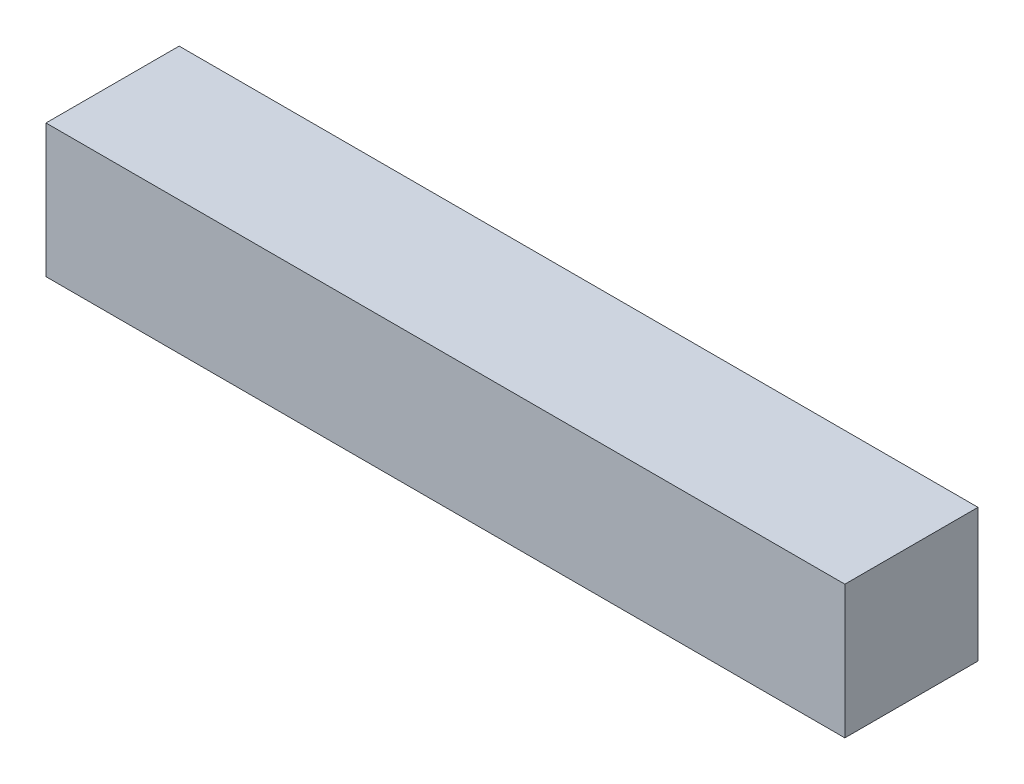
from build123d import *

# Parameters (mm, degrees)
SKETCH1_W      = 120
SKETCH1_H      = 20
EXTRUDE1_DEPTH = 20


with BuildPart() as part:
    # Sketch1 → Extrude1 (new body)
    with BuildSketch(Plane(origin=(0, 0, 0), x_dir=(1, 0, 0), z_dir=(0, 1, 0))):
        with Locations((60, 10)):
            Rectangle(SKETCH1_W, SKETCH1_H)
    extrude(amount=EXTRUDE1_DEPTH)


solid = part.part
